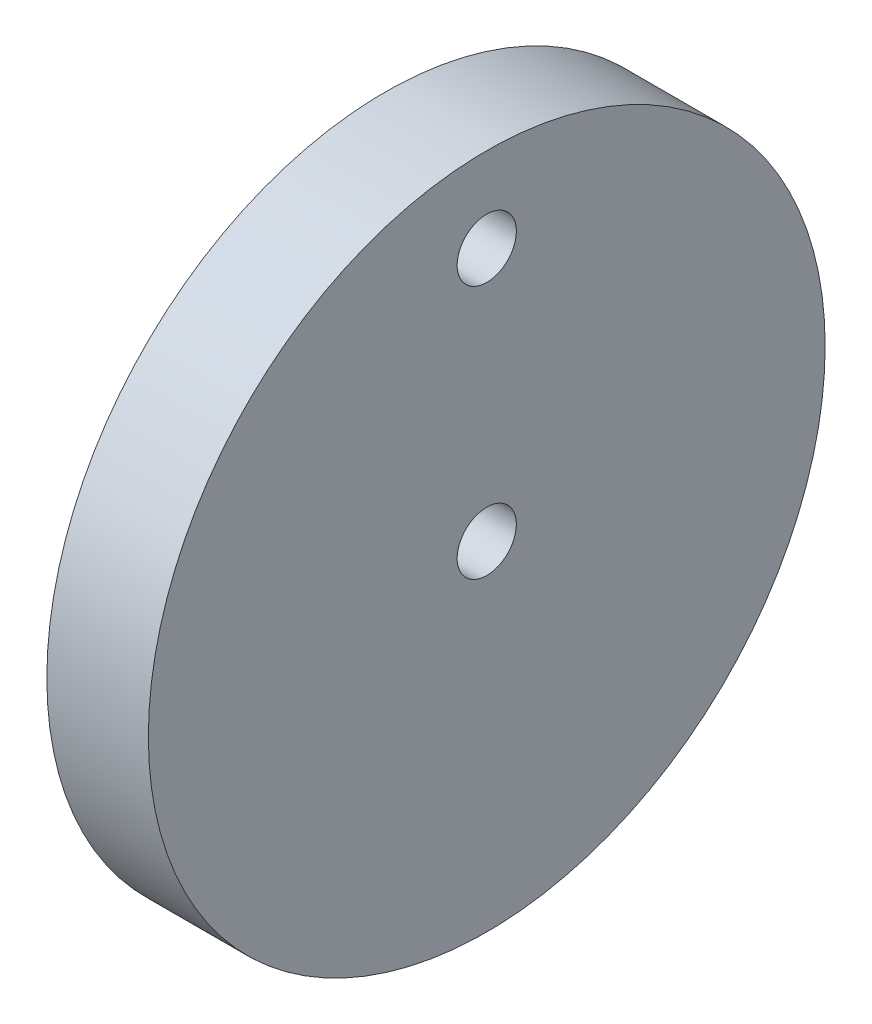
from build123d import *

# Parameters (mm, degrees)
SKETCH1_R      = 20
SKETCH1_R_2    = 1.75
EXTRUDE1_DEPTH = 6


with BuildPart() as part:
    # Sketch1 → Extrude1 (new body)
    with BuildSketch(Plane(origin=(0, 0, 0), x_dir=(0, 0, -1), z_dir=(1, 0, 0))):
        Circle(SKETCH1_R)
        Circle(SKETCH1_R_2, mode=Mode.SUBTRACT)
        with Locations((0, 15)):
            Circle(SKETCH1_R_2, mode=Mode.SUBTRACT)
    extrude(amount=EXTRUDE1_DEPTH)


solid = part.part
